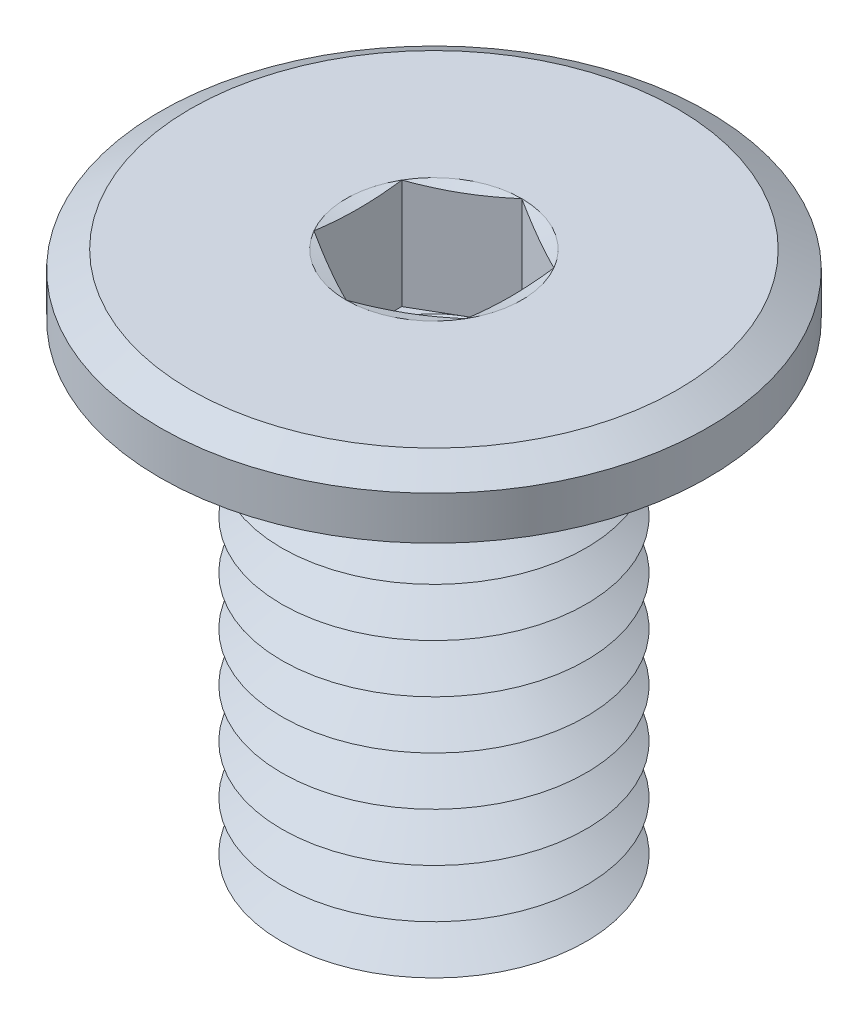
ISO-10303-21;
HEADER;
FILE_DESCRIPTION(('STEP AP214'),'2;1');
FILE_NAME('part.step','',(''),(''),'','','');
FILE_SCHEMA(('AUTOMOTIVE_DESIGN { 1 0 10303 214 1 1 1 1 }'));
ENDSEC;
DATA;
#1=APPLICATION_CONTEXT('core data for automotive mechanical design processes');
#2=APPLICATION_PROTOCOL_DEFINITION('international standard','automotive_design',2000,#1);
#3=PRODUCT_CONTEXT('',#1,'mechanical');
#4=PRODUCT('Part','Part','',(#3));
#5=PRODUCT_RELATED_PRODUCT_CATEGORY('part','',(#4));
#6=PRODUCT_DEFINITION_FORMATION('','',#4);
#7=PRODUCT_DEFINITION_CONTEXT('part definition',#1,'design');
#8=PRODUCT_DEFINITION('design','',#6,#7);
#9=PRODUCT_DEFINITION_SHAPE('','',#8);
#10=(LENGTH_UNIT() NAMED_UNIT(*) SI_UNIT(.MILLI.,.METRE.));
#11=(NAMED_UNIT(*) PLANE_ANGLE_UNIT() SI_UNIT($,.RADIAN.));
#12=(NAMED_UNIT(*) SI_UNIT($,.STERADIAN.) SOLID_ANGLE_UNIT());
#13=UNCERTAINTY_MEASURE_WITH_UNIT(LENGTH_MEASURE(1.E-05),#10,'distance_accuracy_value','');
#14=(GEOMETRIC_REPRESENTATION_CONTEXT(3) GLOBAL_UNCERTAINTY_ASSIGNED_CONTEXT((#13)) GLOBAL_UNIT_ASSIGNED_CONTEXT((#10,
#11,#12)) REPRESENTATION_CONTEXT('',''));
#15=CARTESIAN_POINT('',(0.,0.,0.));
#16=DIRECTION('',(0.,0.,1.));
#17=DIRECTION('',(1.,0.,0.));
#18=AXIS2_PLACEMENT_3D('',#15,#16,#17);
#19=CARTESIAN_POINT('',(0.,-7.8,0.));
#20=DIRECTION('',(0.,-1.,0.));
#21=DIRECTION('',(0.,0.,-1.));
#22=AXIS2_PLACEMENT_3D('',#19,#20,#21);
#23=CONICAL_SURFACE('',#22,2.5,1.0471975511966);
#24=CARTESIAN_POINT('',(0.,-7.4,0.));
#25=DIRECTION('',(0.,1.,0.));
#26=DIRECTION('',(0.,0.,1.));
#27=AXIS2_PLACEMENT_3D('',#24,#25,#26);
#28=CIRCLE('',#27,1.80717967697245);
#29=CARTESIAN_POINT('',(0.,-7.4,1.80717967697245));
#30=VERTEX_POINT('',#29);
#31=EDGE_CURVE('E425',#30,#30,#28,.T.);
#32=ORIENTED_EDGE('',*,*,#31,.F.);
#33=EDGE_LOOP('',(#32));
#34=FACE_BOUND('',#33,.T.);
#35=CARTESIAN_POINT('',(0.,-7.8,0.));
#36=DIRECTION('',(0.,1.,0.));
#37=DIRECTION('',(0.,0.,1.));
#38=AXIS2_PLACEMENT_3D('',#35,#36,#37);
#39=CIRCLE('',#38,2.5);
#40=CARTESIAN_POINT('',(0.,-7.8,2.5));
#41=VERTEX_POINT('',#40);
#42=EDGE_CURVE('E429',#41,#41,#39,.T.);
#43=ORIENTED_EDGE('',*,*,#42,.T.);
#44=EDGE_LOOP('',(#43));
#45=FACE_BOUND('',#44,.T.);
#46=ADVANCED_FACE('F39',(#34,#45),#23,.T.);
#47=CARTESIAN_POINT('',(0.,-7.4,0.));
#48=DIRECTION('',(0.,1.,0.));
#49=DIRECTION('',(0.,0.,1.));
#50=AXIS2_PLACEMENT_3D('',#47,#48,#49);
#51=CONICAL_SURFACE('',#50,1.80717967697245,1.0471975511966);
#52=CARTESIAN_POINT('',(0.,-7.,0.));
#53=DIRECTION('',(0.,1.,0.));
#54=DIRECTION('',(0.,0.,1.));
#55=AXIS2_PLACEMENT_3D('',#52,#53,#54);
#56=CIRCLE('',#55,2.5);
#57=CARTESIAN_POINT('',(0.,-7.,2.5));
#58=VERTEX_POINT('',#57);
#59=EDGE_CURVE('E422',#58,#58,#56,.T.);
#60=ORIENTED_EDGE('',*,*,#59,.F.);
#61=EDGE_LOOP('',(#60));
#62=FACE_BOUND('',#61,.T.);
#63=ORIENTED_EDGE('',*,*,#31,.T.);
#64=EDGE_LOOP('',(#63));
#65=FACE_BOUND('',#64,.T.);
#66=ADVANCED_FACE('F233',(#62,#65),#51,.T.);
#67=CARTESIAN_POINT('',(0.,-9.,0.));
#68=DIRECTION('',(0.,-1.,0.));
#69=DIRECTION('',(0.,0.,-1.));
#70=AXIS2_PLACEMENT_3D('',#67,#68,#69);
#71=PLANE('',#70);
#72=CARTESIAN_POINT('',(0.,-9.,0.));
#73=DIRECTION('',(0.,1.,0.));
#74=DIRECTION('',(0.,0.,1.));
#75=AXIS2_PLACEMENT_3D('',#72,#73,#74);
#76=CIRCLE('',#75,1.80717967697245);
#77=CARTESIAN_POINT('',(0.,-9.,1.80717967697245));
#78=VERTEX_POINT('',#77);
#79=EDGE_CURVE('E299',#78,#78,#76,.T.);
#80=ORIENTED_EDGE('',*,*,#79,.F.);
#81=EDGE_LOOP('',(#80));
#82=FACE_BOUND('',#81,.T.);
#83=ADVANCED_FACE('F239',(#82),#71,.T.);
#84=CARTESIAN_POINT('',(0.,-9.,0.));
#85=DIRECTION('',(0.,1.,0.));
#86=DIRECTION('',(0.,0.,1.));
#87=AXIS2_PLACEMENT_3D('',#84,#85,#86);
#88=CONICAL_SURFACE('',#87,1.80717967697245,1.0471975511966);
#89=CARTESIAN_POINT('',(0.,-8.6,0.));
#90=DIRECTION('',(0.,1.,0.));
#91=DIRECTION('',(0.,0.,1.));
#92=AXIS2_PLACEMENT_3D('',#89,#90,#91);
#93=CIRCLE('',#92,2.5);
#94=CARTESIAN_POINT('',(0.,-8.6,2.5));
#95=VERTEX_POINT('',#94);
#96=EDGE_CURVE('E437',#95,#95,#93,.T.);
#97=ORIENTED_EDGE('',*,*,#96,.F.);
#98=EDGE_LOOP('',(#97));
#99=FACE_BOUND('',#98,.T.);
#100=ORIENTED_EDGE('',*,*,#79,.T.);
#101=EDGE_LOOP('',(#100));
#102=FACE_BOUND('',#101,.T.);
#103=ADVANCED_FACE('F254',(#99,#102),#88,.T.);
#104=CARTESIAN_POINT('',(0.,-8.6,0.));
#105=DIRECTION('',(0.,-1.,0.));
#106=DIRECTION('',(0.,0.,-1.));
#107=AXIS2_PLACEMENT_3D('',#104,#105,#106);
#108=CONICAL_SURFACE('',#107,2.5,1.0471975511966);
#109=CARTESIAN_POINT('',(0.,-8.2,0.));
#110=DIRECTION('',(0.,1.,0.));
#111=DIRECTION('',(0.,0.,1.));
#112=AXIS2_PLACEMENT_3D('',#109,#110,#111);
#113=CIRCLE('',#112,1.80717967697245);
#114=CARTESIAN_POINT('',(0.,-8.2,1.80717967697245));
#115=VERTEX_POINT('',#114);
#116=EDGE_CURVE('E433',#115,#115,#113,.T.);
#117=ORIENTED_EDGE('',*,*,#116,.F.);
#118=EDGE_LOOP('',(#117));
#119=FACE_BOUND('',#118,.T.);
#120=ORIENTED_EDGE('',*,*,#96,.T.);
#121=EDGE_LOOP('',(#120));
#122=FACE_BOUND('',#121,.T.);
#123=ADVANCED_FACE('F250',(#119,#122),#108,.T.);
#124=CARTESIAN_POINT('',(0.,-8.2,0.));
#125=DIRECTION('',(0.,1.,0.));
#126=DIRECTION('',(0.,0.,1.));
#127=AXIS2_PLACEMENT_3D('',#124,#125,#126);
#128=CONICAL_SURFACE('',#127,1.80717967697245,1.0471975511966);
#129=ORIENTED_EDGE('',*,*,#42,.F.);
#130=EDGE_LOOP('',(#129));
#131=FACE_BOUND('',#130,.T.);
#132=ORIENTED_EDGE('',*,*,#116,.T.);
#133=EDGE_LOOP('',(#132));
#134=FACE_BOUND('',#133,.T.);
#135=ADVANCED_FACE('F246',(#131,#134),#128,.T.);
#136=CARTESIAN_POINT('',(0.,-7.,0.));
#137=DIRECTION('',(0.,-1.,0.));
#138=DIRECTION('',(0.,0.,-1.));
#139=AXIS2_PLACEMENT_3D('',#136,#137,#138);
#140=CONICAL_SURFACE('',#139,2.5,1.0471975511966);
#141=CARTESIAN_POINT('',(0.,-6.6,0.));
#142=DIRECTION('',(0.,1.,0.));
#143=DIRECTION('',(0.,0.,1.));
#144=AXIS2_PLACEMENT_3D('',#141,#142,#143);
#145=CIRCLE('',#144,1.80717967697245);
#146=CARTESIAN_POINT('',(0.,-6.6,1.80717967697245));
#147=VERTEX_POINT('',#146);
#148=EDGE_CURVE('E419',#147,#147,#145,.T.);
#149=ORIENTED_EDGE('',*,*,#148,.F.);
#150=EDGE_LOOP('',(#149));
#151=FACE_BOUND('',#150,.T.);
#152=ORIENTED_EDGE('',*,*,#59,.T.);
#153=EDGE_LOOP('',(#152));
#154=FACE_BOUND('',#153,.T.);
#155=ADVANCED_FACE('F249',(#151,#154),#140,.T.);
#156=CARTESIAN_POINT('',(0.,-6.6,0.));
#157=DIRECTION('',(0.,1.,0.));
#158=DIRECTION('',(0.,0.,1.));
#159=AXIS2_PLACEMENT_3D('',#156,#157,#158);
#160=CONICAL_SURFACE('',#159,1.80717967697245,1.0471975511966);
#161=CARTESIAN_POINT('',(0.,-6.2,0.));
#162=DIRECTION('',(0.,1.,0.));
#163=DIRECTION('',(0.,0.,1.));
#164=AXIS2_PLACEMENT_3D('',#161,#162,#163);
#165=CIRCLE('',#164,2.5);
#166=CARTESIAN_POINT('',(0.,-6.2,2.5));
#167=VERTEX_POINT('',#166);
#168=EDGE_CURVE('E415',#167,#167,#165,.T.);
#169=ORIENTED_EDGE('',*,*,#168,.F.);
#170=EDGE_LOOP('',(#169));
#171=FACE_BOUND('',#170,.T.);
#172=ORIENTED_EDGE('',*,*,#148,.T.);
#173=EDGE_LOOP('',(#172));
#174=FACE_BOUND('',#173,.T.);
#175=ADVANCED_FACE('F536',(#171,#174),#160,.T.);
#176=CARTESIAN_POINT('',(0.,-6.2,0.));
#177=DIRECTION('',(0.,-1.,0.));
#178=DIRECTION('',(0.,0.,-1.));
#179=AXIS2_PLACEMENT_3D('',#176,#177,#178);
#180=CONICAL_SURFACE('',#179,2.5,1.0471975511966);
#181=CARTESIAN_POINT('',(0.,-5.8,0.));
#182=DIRECTION('',(0.,1.,0.));
#183=DIRECTION('',(0.,0.,1.));
#184=AXIS2_PLACEMENT_3D('',#181,#182,#183);
#185=CIRCLE('',#184,1.80717967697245);
#186=CARTESIAN_POINT('',(0.,-5.8,1.80717967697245));
#187=VERTEX_POINT('',#186);
#188=EDGE_CURVE('E411',#187,#187,#185,.T.);
#189=ORIENTED_EDGE('',*,*,#188,.F.);
#190=EDGE_LOOP('',(#189));
#191=FACE_BOUND('',#190,.T.);
#192=ORIENTED_EDGE('',*,*,#168,.T.);
#193=EDGE_LOOP('',(#192));
#194=FACE_BOUND('',#193,.T.);
#195=ADVANCED_FACE('F532',(#191,#194),#180,.T.);
#196=CARTESIAN_POINT('',(0.,-5.8,0.));
#197=DIRECTION('',(0.,1.,0.));
#198=DIRECTION('',(0.,0.,1.));
#199=AXIS2_PLACEMENT_3D('',#196,#197,#198);
#200=CONICAL_SURFACE('',#199,1.80717967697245,1.0471975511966);
#201=CARTESIAN_POINT('',(0.,-5.4,0.));
#202=DIRECTION('',(0.,1.,0.));
#203=DIRECTION('',(0.,0.,1.));
#204=AXIS2_PLACEMENT_3D('',#201,#202,#203);
#205=CIRCLE('',#204,2.5);
#206=CARTESIAN_POINT('',(0.,-5.4,2.5));
#207=VERTEX_POINT('',#206);
#208=EDGE_CURVE('E407',#207,#207,#205,.T.);
#209=ORIENTED_EDGE('',*,*,#208,.F.);
#210=EDGE_LOOP('',(#209));
#211=FACE_BOUND('',#210,.T.);
#212=ORIENTED_EDGE('',*,*,#188,.T.);
#213=EDGE_LOOP('',(#212));
#214=FACE_BOUND('',#213,.T.);
#215=ADVANCED_FACE('F528',(#211,#214),#200,.T.);
#216=CARTESIAN_POINT('',(0.,-5.4,0.));
#217=DIRECTION('',(0.,-1.,0.));
#218=DIRECTION('',(0.,0.,-1.));
#219=AXIS2_PLACEMENT_3D('',#216,#217,#218);
#220=CONICAL_SURFACE('',#219,2.5,1.0471975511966);
#221=CARTESIAN_POINT('',(0.,-5.,0.));
#222=DIRECTION('',(0.,1.,0.));
#223=DIRECTION('',(0.,0.,1.));
#224=AXIS2_PLACEMENT_3D('',#221,#222,#223);
#225=CIRCLE('',#224,1.80717967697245);
#226=CARTESIAN_POINT('',(0.,-5.,1.80717967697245));
#227=VERTEX_POINT('',#226);
#228=EDGE_CURVE('E403',#227,#227,#225,.T.);
#229=ORIENTED_EDGE('',*,*,#228,.F.);
#230=EDGE_LOOP('',(#229));
#231=FACE_BOUND('',#230,.T.);
#232=ORIENTED_EDGE('',*,*,#208,.T.);
#233=EDGE_LOOP('',(#232));
#234=FACE_BOUND('',#233,.T.);
#235=ADVANCED_FACE('F524',(#231,#234),#220,.T.);
#236=CARTESIAN_POINT('',(0.,-5.,0.));
#237=DIRECTION('',(0.,1.,0.));
#238=DIRECTION('',(0.,0.,1.));
#239=AXIS2_PLACEMENT_3D('',#236,#237,#238);
#240=CONICAL_SURFACE('',#239,1.80717967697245,1.0471975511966);
#241=CARTESIAN_POINT('',(0.,-4.6,0.));
#242=DIRECTION('',(0.,1.,0.));
#243=DIRECTION('',(0.,0.,1.));
#244=AXIS2_PLACEMENT_3D('',#241,#242,#243);
#245=CIRCLE('',#244,2.5);
#246=CARTESIAN_POINT('',(0.,-4.6,2.5));
#247=VERTEX_POINT('',#246);
#248=EDGE_CURVE('E399',#247,#247,#245,.T.);
#249=ORIENTED_EDGE('',*,*,#248,.F.);
#250=EDGE_LOOP('',(#249));
#251=FACE_BOUND('',#250,.T.);
#252=ORIENTED_EDGE('',*,*,#228,.T.);
#253=EDGE_LOOP('',(#252));
#254=FACE_BOUND('',#253,.T.);
#255=ADVANCED_FACE('F520',(#251,#254),#240,.T.);
#256=CARTESIAN_POINT('',(0.,-4.6,0.));
#257=DIRECTION('',(0.,-1.,0.));
#258=DIRECTION('',(0.,0.,-1.));
#259=AXIS2_PLACEMENT_3D('',#256,#257,#258);
#260=CONICAL_SURFACE('',#259,2.5,1.0471975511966);
#261=CARTESIAN_POINT('',(0.,-4.2,0.));
#262=DIRECTION('',(0.,1.,0.));
#263=DIRECTION('',(0.,0.,1.));
#264=AXIS2_PLACEMENT_3D('',#261,#262,#263);
#265=CIRCLE('',#264,1.80717967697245);
#266=CARTESIAN_POINT('',(0.,-4.2,1.80717967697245));
#267=VERTEX_POINT('',#266);
#268=EDGE_CURVE('E396',#267,#267,#265,.T.);
#269=ORIENTED_EDGE('',*,*,#268,.F.);
#270=EDGE_LOOP('',(#269));
#271=FACE_BOUND('',#270,.T.);
#272=ORIENTED_EDGE('',*,*,#248,.T.);
#273=EDGE_LOOP('',(#272));
#274=FACE_BOUND('',#273,.T.);
#275=ADVANCED_FACE('F516',(#271,#274),#260,.T.);
#276=CARTESIAN_POINT('',(0.,-4.2,0.));
#277=DIRECTION('',(0.,1.,0.));
#278=DIRECTION('',(0.,0.,1.));
#279=AXIS2_PLACEMENT_3D('',#276,#277,#278);
#280=CONICAL_SURFACE('',#279,1.80717967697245,1.0471975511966);
#281=CARTESIAN_POINT('',(0.,-3.8,0.));
#282=DIRECTION('',(0.,1.,0.));
#283=DIRECTION('',(0.,0.,1.));
#284=AXIS2_PLACEMENT_3D('',#281,#282,#283);
#285=CIRCLE('',#284,2.5);
#286=CARTESIAN_POINT('',(0.,-3.8,2.5));
#287=VERTEX_POINT('',#286);
#288=EDGE_CURVE('E392',#287,#287,#285,.T.);
#289=ORIENTED_EDGE('',*,*,#288,.F.);
#290=EDGE_LOOP('',(#289));
#291=FACE_BOUND('',#290,.T.);
#292=ORIENTED_EDGE('',*,*,#268,.T.);
#293=EDGE_LOOP('',(#292));
#294=FACE_BOUND('',#293,.T.);
#295=ADVANCED_FACE('F512',(#291,#294),#280,.T.);
#296=CARTESIAN_POINT('',(0.,-3.8,0.));
#297=DIRECTION('',(0.,-1.,0.));
#298=DIRECTION('',(0.,0.,-1.));
#299=AXIS2_PLACEMENT_3D('',#296,#297,#298);
#300=CONICAL_SURFACE('',#299,2.5,1.0471975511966);
#301=CARTESIAN_POINT('',(0.,-3.4,0.));
#302=DIRECTION('',(0.,1.,0.));
#303=DIRECTION('',(0.,0.,1.));
#304=AXIS2_PLACEMENT_3D('',#301,#302,#303);
#305=CIRCLE('',#304,1.80717967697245);
#306=CARTESIAN_POINT('',(0.,-3.4,1.80717967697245));
#307=VERTEX_POINT('',#306);
#308=EDGE_CURVE('E388',#307,#307,#305,.T.);
#309=ORIENTED_EDGE('',*,*,#308,.F.);
#310=EDGE_LOOP('',(#309));
#311=FACE_BOUND('',#310,.T.);
#312=ORIENTED_EDGE('',*,*,#288,.T.);
#313=EDGE_LOOP('',(#312));
#314=FACE_BOUND('',#313,.T.);
#315=ADVANCED_FACE('F508',(#311,#314),#300,.T.);
#316=CARTESIAN_POINT('',(0.,-3.4,0.));
#317=DIRECTION('',(0.,1.,0.));
#318=DIRECTION('',(0.,0.,1.));
#319=AXIS2_PLACEMENT_3D('',#316,#317,#318);
#320=CONICAL_SURFACE('',#319,1.80717967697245,1.0471975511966);
#321=CARTESIAN_POINT('',(0.,-3.,0.));
#322=DIRECTION('',(0.,1.,0.));
#323=DIRECTION('',(0.,0.,1.));
#324=AXIS2_PLACEMENT_3D('',#321,#322,#323);
#325=CIRCLE('',#324,2.5);
#326=CARTESIAN_POINT('',(0.,-3.,2.5));
#327=VERTEX_POINT('',#326);
#328=EDGE_CURVE('E384',#327,#327,#325,.T.);
#329=ORIENTED_EDGE('',*,*,#328,.F.);
#330=EDGE_LOOP('',(#329));
#331=FACE_BOUND('',#330,.T.);
#332=ORIENTED_EDGE('',*,*,#308,.T.);
#333=EDGE_LOOP('',(#332));
#334=FACE_BOUND('',#333,.T.);
#335=ADVANCED_FACE('F504',(#331,#334),#320,.T.);
#336=CARTESIAN_POINT('',(0.,-3.,0.));
#337=DIRECTION('',(0.,-1.,0.));
#338=DIRECTION('',(0.,0.,-1.));
#339=AXIS2_PLACEMENT_3D('',#336,#337,#338);
#340=CONICAL_SURFACE('',#339,2.5,1.0471975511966);
#341=CARTESIAN_POINT('',(0.,-2.6,0.));
#342=DIRECTION('',(0.,1.,0.));
#343=DIRECTION('',(0.,0.,1.));
#344=AXIS2_PLACEMENT_3D('',#341,#342,#343);
#345=CIRCLE('',#344,1.80717967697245);
#346=CARTESIAN_POINT('',(0.,-2.6,1.80717967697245));
#347=VERTEX_POINT('',#346);
#348=EDGE_CURVE('E380',#347,#347,#345,.T.);
#349=ORIENTED_EDGE('',*,*,#348,.F.);
#350=EDGE_LOOP('',(#349));
#351=FACE_BOUND('',#350,.T.);
#352=ORIENTED_EDGE('',*,*,#328,.T.);
#353=EDGE_LOOP('',(#352));
#354=FACE_BOUND('',#353,.T.);
#355=ADVANCED_FACE('F500',(#351,#354),#340,.T.);
#356=CARTESIAN_POINT('',(0.,-2.6,0.));
#357=DIRECTION('',(0.,1.,0.));
#358=DIRECTION('',(0.,0.,1.));
#359=AXIS2_PLACEMENT_3D('',#356,#357,#358);
#360=CONICAL_SURFACE('',#359,1.80717967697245,1.0471975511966);
#361=CARTESIAN_POINT('',(0.,-2.2,0.));
#362=DIRECTION('',(0.,1.,0.));
#363=DIRECTION('',(0.,0.,1.));
#364=AXIS2_PLACEMENT_3D('',#361,#362,#363);
#365=CIRCLE('',#364,2.5);
#366=CARTESIAN_POINT('',(0.,-2.2,2.5));
#367=VERTEX_POINT('',#366);
#368=EDGE_CURVE('E365',#367,#367,#365,.T.);
#369=ORIENTED_EDGE('',*,*,#368,.F.);
#370=EDGE_LOOP('',(#369));
#371=FACE_BOUND('',#370,.T.);
#372=ORIENTED_EDGE('',*,*,#348,.T.);
#373=EDGE_LOOP('',(#372));
#374=FACE_BOUND('',#373,.T.);
#375=ADVANCED_FACE('F274',(#371,#374),#360,.T.);
#376=CARTESIAN_POINT('',(0.,0.,0.));
#377=DIRECTION('',(0.,1.,0.));
#378=DIRECTION('',(0.,0.,1.));
#379=AXIS2_PLACEMENT_3D('',#376,#377,#378);
#380=PLANE('',#379);
#381=CARTESIAN_POINT('',(0.,0.,0.));
#382=DIRECTION('',(0.,1.,0.));
#383=DIRECTION('',(0.,0.,1.));
#384=AXIS2_PLACEMENT_3D('',#381,#382,#383);
#385=CIRCLE('',#384,1.44337567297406);
#386=CARTESIAN_POINT('',(0.,0.,1.44337567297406));
#387=VERTEX_POINT('',#386);
#388=CARTESIAN_POINT('',(1.25,0.,0.721687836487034));
#389=VERTEX_POINT('',#388);
#390=EDGE_CURVE('E66',#387,#389,#385,.T.);
#391=ORIENTED_EDGE('',*,*,#390,.F.);
#392=CARTESIAN_POINT('',(-1.25,0.,0.721687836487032));
#393=VERTEX_POINT('',#392);
#394=EDGE_CURVE('E169',#393,#387,#385,.T.);
#395=ORIENTED_EDGE('',*,*,#394,.F.);
#396=CARTESIAN_POINT('',(-1.25,0.,-0.721687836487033));
#397=VERTEX_POINT('',#396);
#398=EDGE_CURVE('E164',#397,#393,#385,.T.);
#399=ORIENTED_EDGE('',*,*,#398,.F.);
#400=CARTESIAN_POINT('',(0.,0.,-1.44337567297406));
#401=VERTEX_POINT('',#400);
#402=EDGE_CURVE('E128',#401,#397,#385,.T.);
#403=ORIENTED_EDGE('',*,*,#402,.F.);
#404=CARTESIAN_POINT('',(1.25,0.,-0.721687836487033));
#405=VERTEX_POINT('',#404);
#406=EDGE_CURVE('E119',#405,#401,#385,.T.);
#407=ORIENTED_EDGE('',*,*,#406,.F.);
#408=EDGE_CURVE('E59',#389,#405,#385,.T.);
#409=ORIENTED_EDGE('',*,*,#408,.F.);
#410=EDGE_LOOP('',(#391,#395,#399,#403,#407,#409));
#411=FACE_BOUND('',#410,.T.);
#412=CARTESIAN_POINT('',(0.,0.,0.));
#413=DIRECTION('',(0.,1.,0.));
#414=DIRECTION('',(0.,0.,1.));
#415=AXIS2_PLACEMENT_3D('',#412,#413,#414);
#416=CIRCLE('',#415,4.);
#417=CARTESIAN_POINT('',(0.,0.,4.));
#418=VERTEX_POINT('',#417);
#419=EDGE_CURVE('E295',#418,#418,#416,.T.);
#420=ORIENTED_EDGE('',*,*,#419,.T.);
#421=EDGE_LOOP('',(#420));
#422=FACE_BOUND('',#421,.T.);
#423=ADVANCED_FACE('F160',(#411,#422),#380,.T.);
#424=CARTESIAN_POINT('',(0.,-1.,0.));
#425=DIRECTION('',(0.,1.,0.));
#426=DIRECTION('',(0.,0.,1.));
#427=AXIS2_PLACEMENT_3D('',#424,#425,#426);
#428=CYLINDRICAL_SURFACE('',#427,4.5);
#429=CARTESIAN_POINT('',(0.,-0.288675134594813,0.));
#430=DIRECTION('',(0.,1.,0.));
#431=DIRECTION('',(0.,0.,1.));
#432=AXIS2_PLACEMENT_3D('',#429,#430,#431);
#433=CIRCLE('',#432,4.5);
#434=CARTESIAN_POINT('',(0.,-0.288675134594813,4.5));
#435=VERTEX_POINT('',#434);
#436=EDGE_CURVE('E306',#435,#435,#433,.F.);
#437=ORIENTED_EDGE('',*,*,#436,.T.);
#438=EDGE_LOOP('',(#437));
#439=FACE_BOUND('',#438,.T.);
#440=CARTESIAN_POINT('',(0.,-1.,0.));
#441=DIRECTION('',(0.,1.,0.));
#442=DIRECTION('',(0.,0.,1.));
#443=AXIS2_PLACEMENT_3D('',#440,#441,#442);
#444=CIRCLE('',#443,4.5);
#445=CARTESIAN_POINT('',(0.,-1.,4.5));
#446=VERTEX_POINT('',#445);
#447=EDGE_CURVE('E291',#446,#446,#444,.T.);
#448=ORIENTED_EDGE('',*,*,#447,.T.);
#449=EDGE_LOOP('',(#448));
#450=FACE_BOUND('',#449,.T.);
#451=ADVANCED_FACE('F270',(#439,#450),#428,.T.);
#452=CARTESIAN_POINT('',(0.,-1.,0.));
#453=DIRECTION('',(0.,1.,0.));
#454=DIRECTION('',(0.,0.,1.));
#455=AXIS2_PLACEMENT_3D('',#452,#453,#454);
#456=PLANE('',#455);
#457=CARTESIAN_POINT('',(0.,-1.,0.));
#458=DIRECTION('',(0.,1.,0.));
#459=DIRECTION('',(0.,0.,1.));
#460=AXIS2_PLACEMENT_3D('',#457,#458,#459);
#461=CIRCLE('',#460,2.7);
#462=CARTESIAN_POINT('',(0.,-1.,2.7));
#463=VERTEX_POINT('',#462);
#464=EDGE_CURVE('E286',#463,#463,#461,.T.);
#465=ORIENTED_EDGE('',*,*,#464,.T.);
#466=EDGE_LOOP('',(#465));
#467=FACE_BOUND('',#466,.T.);
#468=ORIENTED_EDGE('',*,*,#447,.F.);
#469=EDGE_LOOP('',(#468));
#470=FACE_BOUND('',#469,.T.);
#471=ADVANCED_FACE('F266',(#467,#470),#456,.F.);
#472=CARTESIAN_POINT('',(0.,-9.,0.));
#473=DIRECTION('',(0.,1.,0.));
#474=DIRECTION('',(0.,0.,1.));
#475=AXIS2_PLACEMENT_3D('',#472,#473,#474);
#476=CYLINDRICAL_SURFACE('',#475,2.5);
#477=CARTESIAN_POINT('',(0.,-1.2,0.));
#478=DIRECTION('',(0.,1.,0.));
#479=DIRECTION('',(0.,0.,1.));
#480=AXIS2_PLACEMENT_3D('',#477,#478,#479);
#481=CIRCLE('',#480,2.5);
#482=CARTESIAN_POINT('',(0.,-1.2,2.5));
#483=VERTEX_POINT('',#482);
#484=EDGE_CURVE('E289',#483,#483,#481,.F.);
#485=ORIENTED_EDGE('',*,*,#484,.T.);
#486=EDGE_LOOP('',(#485));
#487=FACE_BOUND('',#486,.T.);
#488=ORIENTED_EDGE('',*,*,#368,.T.);
#489=EDGE_LOOP('',(#488));
#490=FACE_BOUND('',#489,.T.);
#491=ADVANCED_FACE('F262',(#487,#490),#476,.T.);
#492=CARTESIAN_POINT('',(0.,-1.2,0.));
#493=DIRECTION('',(0.,1.,0.));
#494=DIRECTION('',(0.,0.,1.));
#495=AXIS2_PLACEMENT_3D('',#492,#493,#494);
#496=TOROIDAL_SURFACE('',#495,2.7,0.2);
#497=ORIENTED_EDGE('',*,*,#464,.F.);
#498=EDGE_LOOP('',(#497));
#499=FACE_BOUND('',#498,.T.);
#500=ORIENTED_EDGE('',*,*,#484,.F.);
#501=EDGE_LOOP('',(#500));
#502=FACE_BOUND('',#501,.T.);
#503=ADVANCED_FACE('F265',(#499,#502),#496,.F.);
#504=CARTESIAN_POINT('',(0.,0.,0.));
#505=DIRECTION('',(0.,-1.,0.));
#506=DIRECTION('',(0.,0.,-1.));
#507=AXIS2_PLACEMENT_3D('',#504,#505,#506);
#508=CONICAL_SURFACE('',#507,4.,1.0471975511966);
#509=ORIENTED_EDGE('',*,*,#436,.F.);
#510=EDGE_LOOP('',(#509));
#511=FACE_BOUND('',#510,.T.);
#512=ORIENTED_EDGE('',*,*,#419,.F.);
#513=EDGE_LOOP('',(#512));
#514=FACE_BOUND('',#513,.T.);
#515=ADVANCED_FACE('F41',(#511,#514),#508,.T.);
#516=CARTESIAN_POINT('',(0.,0.,0.));
#517=DIRECTION('',(0.,1.,0.));
#518=DIRECTION('',(0.,0.,1.));
#519=AXIS2_PLACEMENT_3D('',#516,#517,#518);
#520=CONICAL_SURFACE('',#519,1.44337567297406,1.30899693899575);
#521=ORIENTED_EDGE('',*,*,#402,.T.);
#522=CARTESIAN_POINT('',(0.000200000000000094,3.09438201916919E-05,-1.4434911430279));
#523=CARTESIAN_POINT('',(-0.0517259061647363,-0.00800698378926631,-1.41351170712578));
#524=CARTESIAN_POINT('',(-0.103745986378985,-0.0153042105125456,-1.38347789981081));
#525=CARTESIAN_POINT('',(-0.207969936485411,-0.028124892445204,-1.32330417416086));
#526=CARTESIAN_POINT('',(-0.260173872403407,-0.0336476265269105,-1.29316421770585));
#527=CARTESIAN_POINT('',(-0.36444888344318,-0.0425967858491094,-1.23296101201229));
#528=CARTESIAN_POINT('',(-0.416519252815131,-0.0460338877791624,-1.20289817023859));
#529=CARTESIAN_POINT('',(-0.520726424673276,-0.0506427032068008,-1.1427341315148));
#530=CARTESIAN_POINT('',(-0.572863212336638,-0.0518148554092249,-1.11263294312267));
#531=CARTESIAN_POINT('',(-0.677136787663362,-0.0518148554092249,-1.05243056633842));
#532=CARTESIAN_POINT('',(-0.729273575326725,-0.0506427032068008,-1.0223293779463));
#533=CARTESIAN_POINT('',(-0.833480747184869,-0.0460338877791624,-0.96216533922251));
#534=CARTESIAN_POINT('',(-0.88555111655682,-0.0425967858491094,-0.932102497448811));
#535=CARTESIAN_POINT('',(-0.989826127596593,-0.0336476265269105,-0.871899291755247));
#536=CARTESIAN_POINT('',(-1.04203006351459,-0.028124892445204,-0.841759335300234));
#537=CARTESIAN_POINT('',(-1.14625401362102,-0.0153042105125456,-0.781585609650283));
#538=CARTESIAN_POINT('',(-1.19827409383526,-0.0080069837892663,-0.75155180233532));
#539=CARTESIAN_POINT('',(-1.2502,3.09438201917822E-05,-0.721572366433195));
#540=B_SPLINE_CURVE_WITH_KNOTS('',3,(#522,#523,#524,#525,#526,#527,#528,#529,#530,#531,#532,
#533,#534,#535,#536,#537,#538,#539),.UNSPECIFIED.,.F.,.F.,(4,2,2,2,2,2,2,2,4),(0.,
0.18149525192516,0.363064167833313,0.543695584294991,0.724292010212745,0.9048884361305,
1.08551985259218,1.26708876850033,1.44858402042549),.UNSPECIFIED.);
#541=EDGE_CURVE('E11',#401,#397,#540,.T.);
#542=ORIENTED_EDGE('',*,*,#541,.F.);
#543=EDGE_LOOP('',(#521,#542));
#544=FACE_BOUND('',#543,.T.);
#545=ADVANCED_FACE('F132',(#544),#520,.F.);
#546=ORIENTED_EDGE('',*,*,#398,.T.);
#547=CARTESIAN_POINT('',(-1.25,0.295017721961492,-2.21618029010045));
#548=CARTESIAN_POINT('',(-1.25,0.270123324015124,-2.10936606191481));
#549=CARTESIAN_POINT('',(-1.25,0.245578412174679,-2.00246488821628));
#550=CARTESIAN_POINT('',(-1.25,0.197670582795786,-1.78837821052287));
#551=CARTESIAN_POINT('',(-1.25,0.174307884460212,-1.68119265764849));
#552=CARTESIAN_POINT('',(-1.25,0.129037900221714,-1.46542158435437));
#553=CARTESIAN_POINT('',(-1.25,0.107146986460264,-1.35683258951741));
#554=CARTESIAN_POINT('',(-1.25,0.0659326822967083,-1.13914880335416));
#555=CARTESIAN_POINT('',(-1.25,0.0466095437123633,-1.03005396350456));
#556=CARTESIAN_POINT('',(-1.25,0.0123179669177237,-0.814238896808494));
#557=CARTESIAN_POINT('',(-1.25,-0.00275558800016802,-0.707535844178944));
#558=CARTESIAN_POINT('',(-1.25,-0.0275791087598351,-0.493517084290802));
#559=CARTESIAN_POINT('',(-1.25,-0.0373307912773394,-0.386201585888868));
#560=CARTESIAN_POINT('',(-1.25,-0.0498256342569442,-0.171630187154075));
#561=CARTESIAN_POINT('',(-1.25,-0.052600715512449,-0.064376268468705));
#562=CARTESIAN_POINT('',(-1.25,-0.0506356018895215,0.15006745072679));
#563=CARTESIAN_POINT('',(-1.25,-0.0458948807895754,0.257257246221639));
#564=CARTESIAN_POINT('',(-1.25,-0.032096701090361,0.441548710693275));
#565=CARTESIAN_POINT('',(-1.25,-0.0245948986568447,0.518776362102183));
#566=CARTESIAN_POINT('',(-1.25,-0.00682363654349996,0.672906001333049));
#567=CARTESIAN_POINT('',(-1.25,0.003445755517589,0.749807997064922));
#568=CARTESIAN_POINT('',(-1.25,0.0261652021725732,0.903544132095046));
#569=CARTESIAN_POINT('',(-1.25,0.0386223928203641,0.980377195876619));
#570=CARTESIAN_POINT('',(-1.25,0.0651615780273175,1.13376313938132));
#571=CARTESIAN_POINT('',(-1.25,0.0792436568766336,1.21031600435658));
#572=CARTESIAN_POINT('',(-1.25,0.108934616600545,1.36480056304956));
#573=CARTESIAN_POINT('',(-1.25,0.124569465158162,1.44272722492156));
#574=CARTESIAN_POINT('',(-1.25,0.156788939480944,1.59838383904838));
#575=CARTESIAN_POINT('',(-1.25,0.173373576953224,1.67611378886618));
#576=CARTESIAN_POINT('',(-1.25,0.2071623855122,1.83097242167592));
#577=CARTESIAN_POINT('',(-1.25,0.224362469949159,1.90810200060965));
#578=CARTESIAN_POINT('',(-1.25,0.259314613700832,2.06223034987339));
#579=CARTESIAN_POINT('',(-1.25,0.277066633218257,2.13922912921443));
#580=CARTESIAN_POINT('',(-1.25,0.295017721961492,2.21618029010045));
#581=B_SPLINE_CURVE_WITH_KNOTS('',3,(#547,#548,#549,#550,#551,#552,#553,#554,#555,#556,#557,
#558,#559,#560,#561,#562,#563,#564,#565,#566,#567,#568,#569,#570,#571,#572,#573,#574,#575,#576,
#577,#578,#579,#580),.UNSPECIFIED.,.F.,.F.,(4,2,2,2,2,2,2,2,2,2,2,2,2,2,2,2,4),(0.,
0.329038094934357,0.658136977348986,0.990437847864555,1.32277128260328,1.64596801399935,
1.96906043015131,2.29067185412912,2.61230579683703,2.84502466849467,3.07773785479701,
3.31122468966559,3.54472364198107,3.78315484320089,4.0215889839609,4.2586591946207,
4.49571235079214),.UNSPECIFIED.);
#582=EDGE_CURVE('E172',#397,#393,#581,.T.);
#583=ORIENTED_EDGE('',*,*,#582,.F.);
#584=EDGE_LOOP('',(#546,#583));
#585=FACE_BOUND('',#584,.T.);
#586=ADVANCED_FACE('F612',(#585),#520,.F.);
#587=ORIENTED_EDGE('',*,*,#394,.T.);
#588=CARTESIAN_POINT('',(-1.2502,3.09438201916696E-05,0.721572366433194));
#589=CARTESIAN_POINT('',(-1.19827409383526,-0.00800698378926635,0.75155180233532));
#590=CARTESIAN_POINT('',(-1.14625401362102,-0.0153042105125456,0.781585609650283));
#591=CARTESIAN_POINT('',(-1.04203006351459,-0.0281248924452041,0.841759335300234));
#592=CARTESIAN_POINT('',(-0.989826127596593,-0.0336476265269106,0.871899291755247));
#593=CARTESIAN_POINT('',(-0.88555111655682,-0.0425967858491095,0.932102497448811));
#594=CARTESIAN_POINT('',(-0.833480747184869,-0.0460338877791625,0.96216533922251));
#595=CARTESIAN_POINT('',(-0.729273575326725,-0.0506427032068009,1.0223293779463));
#596=CARTESIAN_POINT('',(-0.677136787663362,-0.051814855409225,1.05243056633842));
#597=CARTESIAN_POINT('',(-0.572863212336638,-0.051814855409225,1.11263294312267));
#598=CARTESIAN_POINT('',(-0.520726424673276,-0.0506427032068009,1.1427341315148));
#599=CARTESIAN_POINT('',(-0.416519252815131,-0.0460338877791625,1.20289817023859));
#600=CARTESIAN_POINT('',(-0.36444888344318,-0.0425967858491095,1.23296101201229));
#601=CARTESIAN_POINT('',(-0.260173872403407,-0.0336476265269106,1.29316421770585));
#602=CARTESIAN_POINT('',(-0.207969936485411,-0.0281248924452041,1.32330417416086));
#603=CARTESIAN_POINT('',(-0.103745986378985,-0.0153042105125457,1.38347789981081));
#604=CARTESIAN_POINT('',(-0.0517259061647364,-0.00800698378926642,1.41351170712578));
#605=CARTESIAN_POINT('',(0.000199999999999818,3.09438201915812E-05,1.4434911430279));
#606=B_SPLINE_CURVE_WITH_KNOTS('',3,(#588,#589,#590,#591,#592,#593,#594,#595,#596,#597,#598,
#599,#600,#601,#602,#603,#604,#605),.UNSPECIFIED.,.F.,.F.,(4,2,2,2,2,2,2,2,4),(0.,
0.18149525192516,0.363064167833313,0.543695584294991,0.724292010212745,0.9048884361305,
1.08551985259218,1.26708876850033,1.44858402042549),.UNSPECIFIED.);
#607=EDGE_CURVE('E180',#393,#387,#606,.T.);
#608=ORIENTED_EDGE('',*,*,#607,.F.);
#609=EDGE_LOOP('',(#587,#608));
#610=FACE_BOUND('',#609,.T.);
#611=ADVANCED_FACE('F619',(#610),#520,.F.);
#612=ORIENTED_EDGE('',*,*,#390,.T.);
#613=CARTESIAN_POINT('',(-0.000200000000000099,3.09438201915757E-05,1.4434911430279));
#614=CARTESIAN_POINT('',(0.0517259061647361,-0.00800698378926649,1.41351170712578));
#615=CARTESIAN_POINT('',(0.103745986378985,-0.0153042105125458,1.38347789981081));
#616=CARTESIAN_POINT('',(0.207969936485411,-0.0281248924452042,1.32330417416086));
#617=CARTESIAN_POINT('',(0.260173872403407,-0.0336476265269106,1.29316421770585));
#618=CARTESIAN_POINT('',(0.36444888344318,-0.0425967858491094,1.23296101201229));
#619=CARTESIAN_POINT('',(0.416519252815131,-0.0460338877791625,1.20289817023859));
#620=CARTESIAN_POINT('',(0.520726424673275,-0.0506427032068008,1.1427341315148));
#621=CARTESIAN_POINT('',(0.572863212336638,-0.0518148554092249,1.11263294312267));
#622=CARTESIAN_POINT('',(0.677136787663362,-0.0518148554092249,1.05243056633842));
#623=CARTESIAN_POINT('',(0.729273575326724,-0.0506427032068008,1.0223293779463));
#624=CARTESIAN_POINT('',(0.833480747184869,-0.0460338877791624,0.96216533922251));
#625=CARTESIAN_POINT('',(0.88555111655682,-0.0425967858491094,0.932102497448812));
#626=CARTESIAN_POINT('',(0.989826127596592,-0.0336476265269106,0.871899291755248));
#627=CARTESIAN_POINT('',(1.04203006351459,-0.0281248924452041,0.841759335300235));
#628=CARTESIAN_POINT('',(1.14625401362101,-0.0153042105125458,0.781585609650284));
#629=CARTESIAN_POINT('',(1.19827409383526,-0.00800698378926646,0.751551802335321));
#630=CARTESIAN_POINT('',(1.2502,3.09438201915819E-05,0.721572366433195));
#631=B_SPLINE_CURVE_WITH_KNOTS('',3,(#613,#614,#615,#616,#617,#618,#619,#620,#621,#622,#623,
#624,#625,#626,#627,#628,#629,#630),.UNSPECIFIED.,.F.,.F.,(4,2,2,2,2,2,2,2,4),(0.,
0.18149525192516,0.363064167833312,0.543695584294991,0.724292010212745,0.904888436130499,
1.08551985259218,1.26708876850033,1.44858402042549),.UNSPECIFIED.);
#632=EDGE_CURVE('E199',#387,#389,#631,.T.);
#633=ORIENTED_EDGE('',*,*,#632,.F.);
#634=EDGE_LOOP('',(#612,#633));
#635=FACE_BOUND('',#634,.T.);
#636=ADVANCED_FACE('F627',(#635),#520,.F.);
#637=ORIENTED_EDGE('',*,*,#408,.T.);
#638=CARTESIAN_POINT('',(1.25,0.295017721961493,2.21618029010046));
#639=CARTESIAN_POINT('',(1.25,0.270123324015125,2.10936606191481));
#640=CARTESIAN_POINT('',(1.25,0.245578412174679,2.00246488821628));
#641=CARTESIAN_POINT('',(1.25,0.197670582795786,1.78837821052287));
#642=CARTESIAN_POINT('',(1.25,0.174307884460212,1.6811926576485));
#643=CARTESIAN_POINT('',(1.25,0.129037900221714,1.46542158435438));
#644=CARTESIAN_POINT('',(1.25,0.107146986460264,1.35683258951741));
#645=CARTESIAN_POINT('',(1.25,0.0659326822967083,1.13914880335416));
#646=CARTESIAN_POINT('',(1.25,0.0466095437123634,1.03005396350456));
#647=CARTESIAN_POINT('',(1.25,0.0123179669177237,0.814238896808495));
#648=CARTESIAN_POINT('',(1.25,-0.00275558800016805,0.707535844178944));
#649=CARTESIAN_POINT('',(1.25,-0.0275791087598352,0.493517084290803));
#650=CARTESIAN_POINT('',(1.25,-0.0373307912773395,0.386201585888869));
#651=CARTESIAN_POINT('',(1.25,-0.0498256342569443,0.171630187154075));
#652=CARTESIAN_POINT('',(1.25,-0.0526007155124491,0.0643762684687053));
#653=CARTESIAN_POINT('',(1.25,-0.0506356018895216,-0.15006745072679));
#654=CARTESIAN_POINT('',(1.25,-0.0458948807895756,-0.257257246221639));
#655=CARTESIAN_POINT('',(1.25,-0.0320967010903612,-0.441548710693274));
#656=CARTESIAN_POINT('',(1.25,-0.0245948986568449,-0.518776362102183));
#657=CARTESIAN_POINT('',(1.25,-0.00682363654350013,-0.672906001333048));
#658=CARTESIAN_POINT('',(1.25,0.00344575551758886,-0.749807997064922));
#659=CARTESIAN_POINT('',(1.25,0.0261652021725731,-0.903544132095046));
#660=CARTESIAN_POINT('',(1.25,0.038622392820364,-0.980377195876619));
#661=CARTESIAN_POINT('',(1.25,0.0651615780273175,-1.13376313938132));
#662=CARTESIAN_POINT('',(1.25,0.0792436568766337,-1.21031600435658));
#663=CARTESIAN_POINT('',(1.25,0.108934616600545,-1.36480056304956));
#664=CARTESIAN_POINT('',(1.25,0.124569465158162,-1.44272722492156));
#665=CARTESIAN_POINT('',(1.25,0.156788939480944,-1.59838383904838));
#666=CARTESIAN_POINT('',(1.25,0.173373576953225,-1.67611378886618));
#667=CARTESIAN_POINT('',(1.25,0.2071623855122,-1.83097242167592));
#668=CARTESIAN_POINT('',(1.25,0.224362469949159,-1.90810200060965));
#669=CARTESIAN_POINT('',(1.25,0.259314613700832,-2.0622303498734));
#670=CARTESIAN_POINT('',(1.25,0.277066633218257,-2.13922912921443));
#671=CARTESIAN_POINT('',(1.25,0.295017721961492,-2.21618029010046));
#672=B_SPLINE_CURVE_WITH_KNOTS('',3,(#638,#639,#640,#641,#642,#643,#644,#645,#646,#647,#648,
#649,#650,#651,#652,#653,#654,#655,#656,#657,#658,#659,#660,#661,#662,#663,#664,#665,#666,#667,
#668,#669,#670,#671),.UNSPECIFIED.,.F.,.F.,(4,2,2,2,2,2,2,2,2,2,2,2,2,2,2,2,4),(0.,
0.329038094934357,0.658136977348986,0.990437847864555,1.32277128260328,1.64596801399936,
1.96906043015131,2.29067185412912,2.61230579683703,2.84502466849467,3.07773785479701,
3.3112246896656,3.54472364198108,3.78315484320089,4.02158898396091,4.2586591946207,
4.49571235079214),.UNSPECIFIED.);
#673=EDGE_CURVE('E149',#389,#405,#672,.T.);
#674=ORIENTED_EDGE('',*,*,#673,.F.);
#675=EDGE_LOOP('',(#637,#674));
#676=FACE_BOUND('',#675,.T.);
#677=ADVANCED_FACE('F192',(#676),#520,.F.);
#678=ORIENTED_EDGE('',*,*,#406,.T.);
#679=CARTESIAN_POINT('',(1.2502,3.09438201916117E-05,-0.721572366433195));
#680=CARTESIAN_POINT('',(1.19827409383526,-0.00800698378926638,-0.751551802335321));
#681=CARTESIAN_POINT('',(1.14625401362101,-0.0153042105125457,-0.781585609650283));
#682=CARTESIAN_POINT('',(1.04203006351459,-0.0281248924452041,-0.841759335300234));
#683=CARTESIAN_POINT('',(0.989826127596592,-0.0336476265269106,-0.871899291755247));
#684=CARTESIAN_POINT('',(0.88555111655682,-0.0425967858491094,-0.932102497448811));
#685=CARTESIAN_POINT('',(0.833480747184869,-0.0460338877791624,-0.96216533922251));
#686=CARTESIAN_POINT('',(0.729273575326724,-0.0506427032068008,-1.0223293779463));
#687=CARTESIAN_POINT('',(0.677136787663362,-0.0518148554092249,-1.05243056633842));
#688=CARTESIAN_POINT('',(0.572863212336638,-0.0518148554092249,-1.11263294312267));
#689=CARTESIAN_POINT('',(0.520726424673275,-0.0506427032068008,-1.1427341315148));
#690=CARTESIAN_POINT('',(0.416519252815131,-0.0460338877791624,-1.20289817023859));
#691=CARTESIAN_POINT('',(0.36444888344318,-0.0425967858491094,-1.23296101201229));
#692=CARTESIAN_POINT('',(0.260173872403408,-0.0336476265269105,-1.29316421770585));
#693=CARTESIAN_POINT('',(0.207969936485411,-0.028124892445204,-1.32330417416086));
#694=CARTESIAN_POINT('',(0.103745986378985,-0.0153042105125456,-1.38347789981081));
#695=CARTESIAN_POINT('',(0.0517259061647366,-0.00800698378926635,-1.41351170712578));
#696=CARTESIAN_POINT('',(-0.000199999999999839,3.09438201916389E-05,-1.4434911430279));
#697=B_SPLINE_CURVE_WITH_KNOTS('',3,(#679,#680,#681,#682,#683,#684,#685,#686,#687,#688,#689,
#690,#691,#692,#693,#694,#695,#696),.UNSPECIFIED.,.F.,.F.,(4,2,2,2,2,2,2,2,4),(0.,
0.18149525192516,0.363064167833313,0.543695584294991,0.724292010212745,0.904888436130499,
1.08551985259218,1.26708876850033,1.44858402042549),.UNSPECIFIED.);
#698=EDGE_CURVE('E123',#405,#401,#697,.T.);
#699=ORIENTED_EDGE('',*,*,#698,.F.);
#700=EDGE_LOOP('',(#678,#699));
#701=FACE_BOUND('',#700,.T.);
#702=ADVANCED_FACE('F121',(#701),#520,.F.);
#703=CARTESIAN_POINT('',(0.,-1.8,0.));
#704=DIRECTION('',(0.,1.,0.));
#705=DIRECTION('',(0.,0.,1.));
#706=AXIS2_PLACEMENT_3D('',#703,#704,#705);
#707=CONICAL_SURFACE('',#706,1.25,1.0471975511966);
#708=CARTESIAN_POINT('',(0.,-2.52168783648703,0.));
#709=VERTEX_POINT('',#708);
#710=VERTEX_LOOP('',#709);
#711=FACE_BOUND('',#710,.T.);
#712=CARTESIAN_POINT('',(0.,-1.8,0.));
#713=DIRECTION('',(0.,1.,0.));
#714=DIRECTION('',(0.,0.,1.));
#715=AXIS2_PLACEMENT_3D('',#712,#713,#714);
#716=CIRCLE('',#715,1.25);
#717=CARTESIAN_POINT('',(0.624999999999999,-1.8,1.08253175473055));
#718=VERTEX_POINT('',#717);
#719=CARTESIAN_POINT('',(1.25,-1.8,0.));
#720=VERTEX_POINT('',#719);
#721=EDGE_CURVE('E148',#718,#720,#716,.T.);
#722=ORIENTED_EDGE('',*,*,#721,.T.);
#723=CARTESIAN_POINT('',(0.,-1.8,0.));
#724=DIRECTION('',(0.,1.,0.));
#725=DIRECTION('',(0.,0.,1.));
#726=AXIS2_PLACEMENT_3D('',#723,#724,#725);
#727=CIRCLE('',#726,1.25);
#728=CARTESIAN_POINT('',(0.625,-1.8,-1.08253175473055));
#729=VERTEX_POINT('',#728);
#730=EDGE_CURVE('E53',#720,#729,#727,.T.);
#731=ORIENTED_EDGE('',*,*,#730,.T.);
#732=CARTESIAN_POINT('',(-0.625,-1.8,-1.08253175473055));
#733=VERTEX_POINT('',#732);
#734=EDGE_CURVE('E320',#729,#733,#727,.T.);
#735=ORIENTED_EDGE('',*,*,#734,.T.);
#736=CARTESIAN_POINT('',(-1.25,-1.8,0.));
#737=VERTEX_POINT('',#736);
#738=EDGE_CURVE('E318',#733,#737,#727,.T.);
#739=ORIENTED_EDGE('',*,*,#738,.T.);
#740=CARTESIAN_POINT('',(-0.625,-1.8,1.08253175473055));
#741=VERTEX_POINT('',#740);
#742=EDGE_CURVE('E311',#737,#741,#727,.T.);
#743=ORIENTED_EDGE('',*,*,#742,.T.);
#744=EDGE_CURVE('E309',#741,#718,#727,.T.);
#745=ORIENTED_EDGE('',*,*,#744,.T.);
#746=EDGE_LOOP('',(#722,#731,#735,#739,#743,#745));
#747=FACE_BOUND('',#746,.T.);
#748=ADVANCED_FACE('F191',(#711,#747),#707,.F.);
#749=CARTESIAN_POINT('',(0.,-1.8,0.));
#750=DIRECTION('',(0.,1.,0.));
#751=DIRECTION('',(0.,0.,1.));
#752=AXIS2_PLACEMENT_3D('',#749,#750,#751);
#753=PLANE('',#752);
#754=ORIENTED_EDGE('',*,*,#730,.F.);
#755=DIRECTION('',(0.,0.,-1.));
#756=VECTOR('',#755,1.);
#757=CARTESIAN_POINT('',(1.25,-1.8,0.721687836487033));
#758=LINE('',#757,#756);
#759=CARTESIAN_POINT('',(1.25,-1.8,-0.721687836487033));
#760=VERTEX_POINT('',#759);
#761=EDGE_CURVE('E360',#720,#760,#758,.T.);
#762=ORIENTED_EDGE('',*,*,#761,.T.);
#763=DIRECTION('',(-0.866025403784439,0.,-0.5));
#764=VECTOR('',#763,1.);
#765=CARTESIAN_POINT('',(1.25,-1.8,-0.721687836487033));
#766=LINE('',#765,#764);
#767=EDGE_CURVE('E446',#760,#729,#766,.T.);
#768=ORIENTED_EDGE('',*,*,#767,.T.);
#769=EDGE_LOOP('',(#754,#762,#768));
#770=FACE_BOUND('',#769,.T.);
#771=ADVANCED_FACE('F457',(#770),#753,.T.);
#772=ORIENTED_EDGE('',*,*,#721,.F.);
#773=DIRECTION('',(0.866025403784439,0.,-0.499999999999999));
#774=VECTOR('',#773,1.);
#775=CARTESIAN_POINT('',(0.,-1.8,1.44337567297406));
#776=LINE('',#775,#774);
#777=CARTESIAN_POINT('',(1.25,-1.8,0.721687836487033));
#778=VERTEX_POINT('',#777);
#779=EDGE_CURVE('E355',#718,#778,#776,.T.);
#780=ORIENTED_EDGE('',*,*,#779,.T.);
#781=EDGE_CURVE('E157',#778,#720,#758,.T.);
#782=ORIENTED_EDGE('',*,*,#781,.T.);
#783=EDGE_LOOP('',(#772,#780,#782));
#784=FACE_BOUND('',#783,.T.);
#785=ADVANCED_FACE('F459',(#784),#753,.T.);
#786=ORIENTED_EDGE('',*,*,#744,.F.);
#787=DIRECTION('',(0.866025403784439,0.,0.5));
#788=VECTOR('',#787,1.);
#789=CARTESIAN_POINT('',(-1.25,-1.8,0.721687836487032));
#790=LINE('',#789,#788);
#791=CARTESIAN_POINT('',(0.,-1.8,1.44337567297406));
#792=VERTEX_POINT('',#791);
#793=EDGE_CURVE('E348',#741,#792,#790,.T.);
#794=ORIENTED_EDGE('',*,*,#793,.T.);
#795=EDGE_CURVE('E356',#792,#718,#776,.T.);
#796=ORIENTED_EDGE('',*,*,#795,.T.);
#797=EDGE_LOOP('',(#786,#794,#796));
#798=FACE_BOUND('',#797,.T.);
#799=ADVANCED_FACE('F220',(#798),#753,.T.);
#800=ORIENTED_EDGE('',*,*,#742,.F.);
#801=DIRECTION('',(0.,0.,1.));
#802=VECTOR('',#801,1.);
#803=CARTESIAN_POINT('',(-1.25,-1.8,-0.721687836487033));
#804=LINE('',#803,#802);
#805=CARTESIAN_POINT('',(-1.25,-1.8,0.721687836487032));
#806=VERTEX_POINT('',#805);
#807=EDGE_CURVE('E337',#737,#806,#804,.T.);
#808=ORIENTED_EDGE('',*,*,#807,.T.);
#809=EDGE_CURVE('E340',#806,#741,#790,.T.);
#810=ORIENTED_EDGE('',*,*,#809,.T.);
#811=EDGE_LOOP('',(#800,#808,#810));
#812=FACE_BOUND('',#811,.T.);
#813=ADVANCED_FACE('F336',(#812),#753,.T.);
#814=ORIENTED_EDGE('',*,*,#734,.F.);
#815=CARTESIAN_POINT('',(0.,-1.8,-1.44337567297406));
#816=VERTEX_POINT('',#815);
#817=EDGE_CURVE('E449',#729,#816,#766,.T.);
#818=ORIENTED_EDGE('',*,*,#817,.T.);
#819=DIRECTION('',(-0.866025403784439,0.,0.5));
#820=VECTOR('',#819,1.);
#821=CARTESIAN_POINT('',(0.,-1.8,-1.44337567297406));
#822=LINE('',#821,#820);
#823=EDGE_CURVE('E154',#816,#733,#822,.T.);
#824=ORIENTED_EDGE('',*,*,#823,.T.);
#825=EDGE_LOOP('',(#814,#818,#824));
#826=FACE_BOUND('',#825,.T.);
#827=ADVANCED_FACE('F477',(#826),#753,.T.);
#828=ORIENTED_EDGE('',*,*,#738,.F.);
#829=CARTESIAN_POINT('',(-1.25,-1.8,-0.721687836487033));
#830=VERTEX_POINT('',#829);
#831=EDGE_CURVE('E347',#733,#830,#822,.T.);
#832=ORIENTED_EDGE('',*,*,#831,.T.);
#833=EDGE_CURVE('E342',#830,#737,#804,.T.);
#834=ORIENTED_EDGE('',*,*,#833,.T.);
#835=EDGE_LOOP('',(#828,#832,#834));
#836=FACE_BOUND('',#835,.T.);
#837=ADVANCED_FACE('F346',(#836),#753,.T.);
#838=CARTESIAN_POINT('',(0.,-1.8,-1.44337567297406));
#839=DIRECTION('',(-0.5,0.,-0.866025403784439));
#840=DIRECTION('',(-0.866025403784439,0.,0.5));
#841=AXIS2_PLACEMENT_3D('',#838,#839,#840);
#842=PLANE('',#841);
#843=DIRECTION('',(0.,1.,0.));
#844=VECTOR('',#843,1.);
#845=CARTESIAN_POINT('',(0.,-1.8,-1.44337567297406));
#846=LINE('',#845,#844);
#847=EDGE_CURVE('E142',#816,#401,#846,.T.);
#848=ORIENTED_EDGE('',*,*,#847,.T.);
#849=ORIENTED_EDGE('',*,*,#541,.T.);
#850=DIRECTION('',(0.,1.,0.));
#851=VECTOR('',#850,1.);
#852=CARTESIAN_POINT('',(-1.25,-1.8,-0.721687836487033));
#853=LINE('',#852,#851);
#854=EDGE_CURVE('E156',#830,#397,#853,.T.);
#855=ORIENTED_EDGE('',*,*,#854,.F.);
#856=ORIENTED_EDGE('',*,*,#831,.F.);
#857=ORIENTED_EDGE('',*,*,#823,.F.);
#858=EDGE_LOOP('',(#848,#849,#855,#856,#857));
#859=FACE_BOUND('',#858,.T.);
#860=ADVANCED_FACE('F151',(#859),#842,.F.);
#861=CARTESIAN_POINT('',(-1.25,-1.8,-0.721687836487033));
#862=DIRECTION('',(-1.,0.,0.));
#863=DIRECTION('',(0.,0.,1.));
#864=AXIS2_PLACEMENT_3D('',#861,#862,#863);
#865=PLANE('',#864);
#866=ORIENTED_EDGE('',*,*,#854,.T.);
#867=ORIENTED_EDGE('',*,*,#582,.T.);
#868=DIRECTION('',(0.,1.,0.));
#869=VECTOR('',#868,1.);
#870=CARTESIAN_POINT('',(-1.25,-1.8,0.721687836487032));
#871=LINE('',#870,#869);
#872=EDGE_CURVE('E343',#806,#393,#871,.T.);
#873=ORIENTED_EDGE('',*,*,#872,.F.);
#874=ORIENTED_EDGE('',*,*,#807,.F.);
#875=ORIENTED_EDGE('',*,*,#833,.F.);
#876=EDGE_LOOP('',(#866,#867,#873,#874,#875));
#877=FACE_BOUND('',#876,.T.);
#878=ADVANCED_FACE('F186',(#877),#865,.F.);
#879=CARTESIAN_POINT('',(-1.25,-1.8,0.721687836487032));
#880=DIRECTION('',(-0.5,0.,0.866025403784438));
#881=DIRECTION('',(0.866025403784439,0.,0.5));
#882=AXIS2_PLACEMENT_3D('',#879,#880,#881);
#883=PLANE('',#882);
#884=ORIENTED_EDGE('',*,*,#872,.T.);
#885=ORIENTED_EDGE('',*,*,#607,.T.);
#886=DIRECTION('',(0.,1.,0.));
#887=VECTOR('',#886,1.);
#888=CARTESIAN_POINT('',(0.,-1.8,1.44337567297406));
#889=LINE('',#888,#887);
#890=EDGE_CURVE('E370',#792,#387,#889,.T.);
#891=ORIENTED_EDGE('',*,*,#890,.F.);
#892=ORIENTED_EDGE('',*,*,#793,.F.);
#893=ORIENTED_EDGE('',*,*,#809,.F.);
#894=EDGE_LOOP('',(#884,#885,#891,#892,#893));
#895=FACE_BOUND('',#894,.T.);
#896=ADVANCED_FACE('F223',(#895),#883,.F.);
#897=CARTESIAN_POINT('',(0.,-1.8,1.44337567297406));
#898=DIRECTION('',(0.499999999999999,0.,0.866025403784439));
#899=DIRECTION('',(0.866025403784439,0.,-0.5));
#900=AXIS2_PLACEMENT_3D('',#897,#898,#899);
#901=PLANE('',#900);
#902=ORIENTED_EDGE('',*,*,#890,.T.);
#903=ORIENTED_EDGE('',*,*,#632,.T.);
#904=DIRECTION('',(0.,1.,0.));
#905=VECTOR('',#904,1.);
#906=CARTESIAN_POINT('',(1.25,-1.8,0.721687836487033));
#907=LINE('',#906,#905);
#908=EDGE_CURVE('E366',#778,#389,#907,.T.);
#909=ORIENTED_EDGE('',*,*,#908,.F.);
#910=ORIENTED_EDGE('',*,*,#779,.F.);
#911=ORIENTED_EDGE('',*,*,#795,.F.);
#912=EDGE_LOOP('',(#902,#903,#909,#910,#911));
#913=FACE_BOUND('',#912,.T.);
#914=ADVANCED_FACE('F218',(#913),#901,.F.);
#915=CARTESIAN_POINT('',(1.25,-1.8,0.721687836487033));
#916=DIRECTION('',(1.,0.,0.));
#917=DIRECTION('',(0.,0.,-1.));
#918=AXIS2_PLACEMENT_3D('',#915,#916,#917);
#919=PLANE('',#918);
#920=ORIENTED_EDGE('',*,*,#908,.T.);
#921=ORIENTED_EDGE('',*,*,#673,.T.);
#922=DIRECTION('',(0.,1.,0.));
#923=VECTOR('',#922,1.);
#924=CARTESIAN_POINT('',(1.25,-1.8,-0.721687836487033));
#925=LINE('',#924,#923);
#926=EDGE_CURVE('E146',#760,#405,#925,.T.);
#927=ORIENTED_EDGE('',*,*,#926,.F.);
#928=ORIENTED_EDGE('',*,*,#761,.F.);
#929=ORIENTED_EDGE('',*,*,#781,.F.);
#930=EDGE_LOOP('',(#920,#921,#927,#928,#929));
#931=FACE_BOUND('',#930,.T.);
#932=ADVANCED_FACE('F215',(#931),#919,.F.);
#933=CARTESIAN_POINT('',(1.25,-1.8,-0.721687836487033));
#934=DIRECTION('',(0.5,0.,-0.866025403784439));
#935=DIRECTION('',(-0.866025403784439,0.,-0.5));
#936=AXIS2_PLACEMENT_3D('',#933,#934,#935);
#937=PLANE('',#936);
#938=ORIENTED_EDGE('',*,*,#926,.T.);
#939=ORIENTED_EDGE('',*,*,#698,.T.);
#940=ORIENTED_EDGE('',*,*,#847,.F.);
#941=ORIENTED_EDGE('',*,*,#817,.F.);
#942=ORIENTED_EDGE('',*,*,#767,.F.);
#943=EDGE_LOOP('',(#938,#939,#940,#941,#942));
#944=FACE_BOUND('',#943,.T.);
#945=ADVANCED_FACE('F140',(#944),#937,.F.);
#946=CLOSED_SHELL('',(#46,#66,#83,#103,#123,#135,#155,#175,#195,#215,#235,#255,#275,#295,#315,
#335,#355,#375,#423,#451,#471,#491,#503,#515,#545,#586,#611,#636,#677,#702,#748,#771,#785,#799,
#813,#827,#837,#860,#878,#896,#914,#932,#945));
#947=MANIFOLD_SOLID_BREP('B2',#946);
#948=ADVANCED_BREP_SHAPE_REPRESENTATION('',(#18,#947),#14);
#949=SHAPE_DEFINITION_REPRESENTATION(#9,#948);
ENDSEC;
END-ISO-10303-21;
